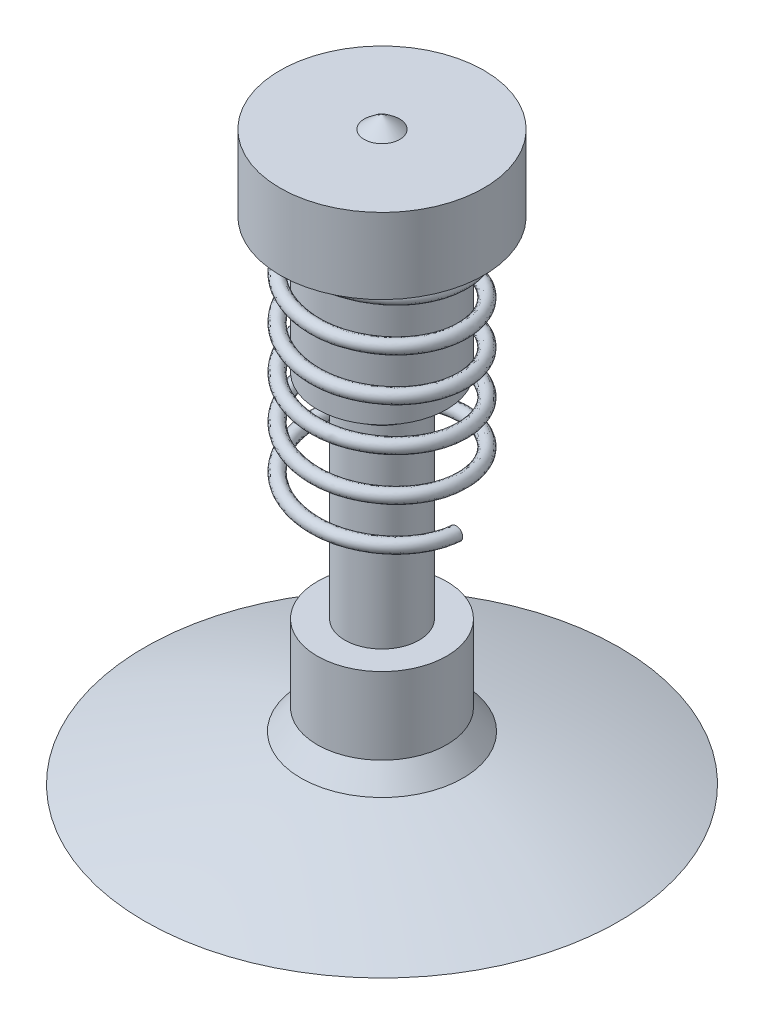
ISO-10303-21;
HEADER;
FILE_DESCRIPTION(('STEP AP214'),'2;1');
FILE_NAME('part.step','',(''),(''),'','','');
FILE_SCHEMA(('AUTOMOTIVE_DESIGN { 1 0 10303 214 1 1 1 1 }'));
ENDSEC;
DATA;
#1=APPLICATION_CONTEXT('core data for automotive mechanical design processes');
#2=APPLICATION_PROTOCOL_DEFINITION('international standard','automotive_design',2000,#1);
#3=PRODUCT_CONTEXT('',#1,'mechanical');
#4=PRODUCT('Part','Part','',(#3));
#5=PRODUCT_RELATED_PRODUCT_CATEGORY('part','',(#4));
#6=PRODUCT_DEFINITION_FORMATION('','',#4);
#7=PRODUCT_DEFINITION_CONTEXT('part definition',#1,'design');
#8=PRODUCT_DEFINITION('design','',#6,#7);
#9=PRODUCT_DEFINITION_SHAPE('','',#8);
#10=(LENGTH_UNIT() NAMED_UNIT(*) SI_UNIT(.MILLI.,.METRE.));
#11=(NAMED_UNIT(*) PLANE_ANGLE_UNIT() SI_UNIT($,.RADIAN.));
#12=(NAMED_UNIT(*) SI_UNIT($,.STERADIAN.) SOLID_ANGLE_UNIT());
#13=UNCERTAINTY_MEASURE_WITH_UNIT(LENGTH_MEASURE(1.E-05),#10,'distance_accuracy_value','');
#14=(GEOMETRIC_REPRESENTATION_CONTEXT(3) GLOBAL_UNCERTAINTY_ASSIGNED_CONTEXT((#13)) GLOBAL_UNIT_ASSIGNED_CONTEXT((#10,
#11,#12)) REPRESENTATION_CONTEXT('',''));
#15=CARTESIAN_POINT('',(0.,0.,0.));
#16=DIRECTION('',(0.,0.,1.));
#17=DIRECTION('',(1.,0.,0.));
#18=AXIS2_PLACEMENT_3D('',#15,#16,#17);
#19=CARTESIAN_POINT('',(0.3,2.28,0.));
#20=DIRECTION('',(0.,1.,0.));
#21=DIRECTION('',(0.,0.,1.));
#22=AXIS2_PLACEMENT_3D('',#19,#20,#21);
#23=PLANE('',#22);
#24=CARTESIAN_POINT('',(0.,2.28,0.));
#25=DIRECTION('',(0.,1.,0.));
#26=DIRECTION('',(0.,0.,1.));
#27=AXIS2_PLACEMENT_3D('',#24,#25,#26);
#28=CIRCLE('',#27,0.3);
#29=CARTESIAN_POINT('',(0.,2.28,0.3));
#30=VERTEX_POINT('',#29);
#31=EDGE_CURVE('E78',#30,#30,#28,.T.);
#32=ORIENTED_EDGE('',*,*,#31,.T.);
#33=EDGE_LOOP('',(#32));
#34=FACE_BOUND('',#33,.T.);
#35=CARTESIAN_POINT('',(0.,2.28,0.));
#36=DIRECTION('',(0.,1.,0.));
#37=DIRECTION('',(0.,0.,1.));
#38=AXIS2_PLACEMENT_3D('',#35,#36,#37);
#39=CIRCLE('',#38,0.472614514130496);
#40=CARTESIAN_POINT('',(0.,2.28,0.472614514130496));
#41=VERTEX_POINT('',#40);
#42=EDGE_CURVE('E75',#41,#41,#39,.T.);
#43=ORIENTED_EDGE('',*,*,#42,.F.);
#44=EDGE_LOOP('',(#43));
#45=FACE_BOUND('',#44,.T.);
#46=DIRECTION('',(1.,0.,0.));
#47=VECTOR('',#46,1.);
#48=CARTESIAN_POINT('',(0.3,2.28,0.));
#49=LINE('',#48,#47);
#50=CARTESIAN_POINT('',(-0.374,2.28,0.));
#51=VERTEX_POINT('',#50);
#52=CARTESIAN_POINT('',(-0.314,2.28,0.));
#53=VERTEX_POINT('',#52);
#54=EDGE_CURVE('E11',#51,#53,#49,.T.);
#55=ORIENTED_EDGE('',*,*,#54,.F.);
#56=CARTESIAN_POINT('',(-0.314,2.28,0.));
#57=CARTESIAN_POINT('',(-0.31400021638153,2.27999999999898,0.00996292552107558));
#58=CARTESIAN_POINT('',(-0.313567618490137,2.27999999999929,0.0199201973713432));
#59=CARTESIAN_POINT('',(-0.311855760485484,2.28000000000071,0.0397696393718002));
#60=CARTESIAN_POINT('',(-0.310575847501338,2.2800000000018,0.0496617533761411));
#61=CARTESIAN_POINT('',(-0.305455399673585,2.28000000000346,0.0793641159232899));
#62=CARTESIAN_POINT('',(-0.300334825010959,2.2800000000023,0.0989664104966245));
#63=CARTESIAN_POINT('',(-0.286986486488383,2.2799999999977,0.137080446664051));
#64=CARTESIAN_POINT('',(-0.278756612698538,2.27999999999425,0.155591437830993));
#65=CARTESIAN_POINT('',(-0.264292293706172,2.27999999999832,0.182562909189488));
#66=CARTESIAN_POINT('',(-0.25901758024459,2.28000000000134,0.191554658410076));
#67=CARTESIAN_POINT('',(-0.247875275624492,2.27999999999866,0.209143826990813));
#68=CARTESIAN_POINT('',(-0.242008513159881,2.27999999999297,0.217741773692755));
#69=CARTESIAN_POINT('',(-0.231938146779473,2.28000000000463,0.231760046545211));
#70=CARTESIAN_POINT('',(-0.227849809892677,2.28000000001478,0.237263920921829));
#71=CARTESIAN_POINT('',(-0.219615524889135,2.27999999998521,0.248227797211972));
#72=CARTESIAN_POINT('',(-0.215469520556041,2.27999999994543,0.253687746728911));
#73=CARTESIAN_POINT('',(-0.209566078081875,2.28000000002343,0.262088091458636));
#74=CARTESIAN_POINT('',(-0.207661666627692,2.28000000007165,0.264905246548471));
#75=CARTESIAN_POINT('',(-0.205578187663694,2.2799999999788,0.268766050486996));
#76=CARTESIAN_POINT('',(-0.205128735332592,2.27999999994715,0.269661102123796));
#77=CARTESIAN_POINT('',(-0.204313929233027,2.27999999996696,0.271552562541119));
#78=CARTESIAN_POINT('',(-0.203953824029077,2.28000000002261,0.272551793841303));
#79=CARTESIAN_POINT('',(-0.203688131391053,2.27999999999,0.274045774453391));
#80=CARTESIAN_POINT('',(-0.20364105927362,2.2799999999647,0.274511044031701));
#81=CARTESIAN_POINT('',(-0.203673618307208,2.27999999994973,0.275376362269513));
#82=CARTESIAN_POINT('',(-0.203735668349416,2.27999999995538,0.275775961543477));
#83=CARTESIAN_POINT('',(-0.204109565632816,2.2799999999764,0.276712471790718));
#84=CARTESIAN_POINT('',(-0.204535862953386,2.27999999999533,0.277210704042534));
#85=CARTESIAN_POINT('',(-0.205429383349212,2.28000000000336,0.27778033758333));
#86=CARTESIAN_POINT('',(-0.205855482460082,2.27999999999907,0.27793006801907));
#87=CARTESIAN_POINT('',(-0.207106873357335,2.27999999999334,0.278227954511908));
#88=CARTESIAN_POINT('',(-0.207952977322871,2.27999999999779,0.278258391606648));
#89=CARTESIAN_POINT('',(-0.210200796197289,2.28000000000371,0.278156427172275));
#90=CARTESIAN_POINT('',(-0.211589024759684,2.28000000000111,0.277899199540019));
#91=CARTESIAN_POINT('',(-0.21433204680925,2.27999999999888,0.277229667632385));
#92=CARTESIAN_POINT('',(-0.215686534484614,2.27999999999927,0.27681627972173));
#93=CARTESIAN_POINT('',(-0.219738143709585,2.27999999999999,0.275422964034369));
#94=CARTESIAN_POINT('',(-0.222384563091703,2.27999999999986,0.274297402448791));
#95=CARTESIAN_POINT('',(-0.22758457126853,2.28000000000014,0.271846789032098));
#96=CARTESIAN_POINT('',(-0.23013793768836,2.28000000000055,0.270521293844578));
#97=CARTESIAN_POINT('',(-0.237674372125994,2.27999999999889,0.266331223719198));
#98=CARTESIAN_POINT('',(-0.242537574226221,2.27999999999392,0.263251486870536));
#99=CARTESIAN_POINT('',(-0.259293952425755,2.27999999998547,0.251680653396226));
#100=CARTESIAN_POINT('',(-0.270475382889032,2.2799999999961,0.242162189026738));
#101=CARTESIAN_POINT('',(-0.291271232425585,2.28000000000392,0.221496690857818));
#102=CARTESIAN_POINT('',(-0.30087765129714,2.28000000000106,0.210341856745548));
#103=CARTESIAN_POINT('',(-0.318603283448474,2.27999999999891,0.186501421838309));
#104=CARTESIAN_POINT('',(-0.326682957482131,2.27999999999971,0.173786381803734));
#105=CARTESIAN_POINT('',(-0.340974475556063,2.28000000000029,0.147395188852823));
#106=CARTESIAN_POINT('',(-0.347190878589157,2.28000000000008,0.133721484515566));
#107=CARTESIAN_POINT('',(-0.358791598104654,2.27999999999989,0.102806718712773));
#108=CARTESIAN_POINT('',(-0.363750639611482,2.27999999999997,0.08540507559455));
#109=CARTESIAN_POINT('',(-0.370842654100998,2.28000000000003,0.0500571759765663));
#110=CARTESIAN_POINT('',(-0.372979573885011,2.28,0.0321117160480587));
#111=CARTESIAN_POINT('',(-0.373904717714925,2.28,0.00942030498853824));
#112=CARTESIAN_POINT('',(-0.374000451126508,2.28,0.00470922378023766));
#113=CARTESIAN_POINT('',(-0.374,2.28,0.));
#114=B_SPLINE_CURVE_WITH_KNOTS('',3,(#56,#57,#58,#59,#60,#61,#62,#63,#64,#65,#66,#67,#68,#69,
#70,#71,#72,#73,#74,#75,#76,#77,#78,#79,#80,#81,#82,#83,#84,#85,#86,#87,#88,#89,#90,#91,#92,#93,
#94,#95,#96,#97,#98,#99,#100,#101,#102,#103,#104,#105,#106,#107,#108,#109,#110,#111,#112,#113),
.UNSPECIFIED.,.F.,.F.,(4,2,2,2,2,2,2,2,2,2,2,2,2,2,2,2,2,2,2,2,2,2,2,2,2,2,2,2,4),(0.,
0.0298688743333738,0.0597607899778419,0.120237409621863,0.180755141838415,0.212006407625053,
0.243214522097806,0.26377785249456,0.284362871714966,0.294530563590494,0.297535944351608,
0.300689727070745,0.302084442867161,0.303274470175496,0.305091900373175,0.306425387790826,
0.308934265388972,0.313149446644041,0.317394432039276,0.326001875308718,0.334628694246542,
0.351870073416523,0.395672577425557,0.439691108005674,0.484727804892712,0.529653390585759,
0.583701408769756,0.637673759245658,0.651805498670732),.UNSPECIFIED.);
#115=EDGE_CURVE('E46',#53,#51,#114,.T.);
#116=ORIENTED_EDGE('',*,*,#115,.F.);
#117=EDGE_LOOP('',(#55,#116));
#118=FACE_BOUND('',#117,.T.);
#119=ADVANCED_FACE('F38',(#34,#45,#118),#23,.F.);
#120=CARTESIAN_POINT('',(0.,2.11836840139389,-0.353368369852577));
#121=DIRECTION('',(-1.,0.,0.));
#122=DIRECTION('',(0.,0.,1.));
#123=AXIS2_PLACEMENT_3D('',#120,#121,#122);
#124=CIRCLE('',#123,0.672035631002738);
#125=TRIMMED_CURVE('',#124,(PARAMETER_VALUE(-1.01711992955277)),
(PARAMETER_VALUE(1.01711992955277)),.T.,.PARAMETER.);
#126=CARTESIAN_POINT('',(0.,2.11836840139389,0.));
#127=DIRECTION('',(0.,1.,0.));
#128=AXIS1_PLACEMENT('',#126,#127);
#129=SURFACE_OF_REVOLUTION('',#125,#128);
#130=CARTESIAN_POINT('',(0.,2.69,0.));
#131=VERTEX_POINT('',#130);
#132=VERTEX_LOOP('',#131);
#133=FACE_BOUND('',#132,.T.);
#134=CARTESIAN_POINT('',(0.,2.63,0.));
#135=DIRECTION('',(0.,1.,0.));
#136=DIRECTION('',(0.,0.,1.));
#137=AXIS2_PLACEMENT_3D('',#134,#135,#136);
#138=CIRCLE('',#137,0.0823666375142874);
#139=CARTESIAN_POINT('',(0.,2.63,0.0823666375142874));
#140=VERTEX_POINT('',#139);
#141=EDGE_CURVE('E67',#140,#140,#138,.T.);
#142=ORIENTED_EDGE('',*,*,#141,.T.);
#143=EDGE_LOOP('',(#142));
#144=FACE_BOUND('',#143,.T.);
#145=ADVANCED_FACE('F40',(#133,#144),#129,.T.);
#146=CARTESIAN_POINT('',(0.,0.,0.));
#147=DIRECTION('',(0.,1.,0.));
#148=DIRECTION('',(0.,0.,1.));
#149=AXIS2_PLACEMENT_3D('',#146,#147,#148);
#150=PLANE('',#149);
#151=CARTESIAN_POINT('',(0.,0.,0.));
#152=DIRECTION('',(0.,1.,0.));
#153=DIRECTION('',(0.,0.,1.));
#154=AXIS2_PLACEMENT_3D('',#151,#152,#153);
#155=CIRCLE('',#154,1.1);
#156=CARTESIAN_POINT('',(0.,0.,1.1));
#157=VERTEX_POINT('',#156);
#158=EDGE_CURVE('E62',#157,#157,#155,.T.);
#159=ORIENTED_EDGE('',*,*,#158,.F.);
#160=EDGE_LOOP('',(#159));
#161=FACE_BOUND('',#160,.T.);
#162=ADVANCED_FACE('F146',(#161),#150,.F.);
#163=CARTESIAN_POINT('',(0.,-4.93281597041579,0.));
#164=DIRECTION('',(0.,1.,0.));
#165=DIRECTION('',(0.,0.,1.));
#166=AXIS2_PLACEMENT_3D('',#163,#164,#165);
#167=DEGENERATE_TOROIDAL_SURFACE('',#166,0.740250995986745,5.26490238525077,.F.);
#168=CARTESIAN_POINT('',(0.,0.212454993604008,0.));
#169=DIRECTION('',(0.,1.,0.));
#170=DIRECTION('',(0.,0.,1.));
#171=AXIS2_PLACEMENT_3D('',#168,#169,#170);
#172=CIRCLE('',#171,0.375716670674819);
#173=CARTESIAN_POINT('',(0.,0.212454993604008,0.375716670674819));
#174=VERTEX_POINT('',#173);
#175=EDGE_CURVE('E96',#174,#174,#172,.T.);
#176=ORIENTED_EDGE('',*,*,#175,.F.);
#177=EDGE_LOOP('',(#176));
#178=FACE_BOUND('',#177,.T.);
#179=ORIENTED_EDGE('',*,*,#158,.T.);
#180=EDGE_LOOP('',(#179));
#181=FACE_BOUND('',#180,.T.);
#182=ADVANCED_FACE('F179',(#178,#181),#167,.F.);
#183=CARTESIAN_POINT('',(0.,0.212454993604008,0.));
#184=DIRECTION('',(0.,-1.,0.));
#185=DIRECTION('',(0.,0.,-1.));
#186=AXIS2_PLACEMENT_3D('',#183,#184,#185);
#187=CONICAL_SURFACE('',#186,0.375716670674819,0.666999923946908);
#188=CARTESIAN_POINT('',(0.,0.30861748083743,0.));
#189=DIRECTION('',(0.,1.,0.));
#190=DIRECTION('',(0.,0.,1.));
#191=AXIS2_PLACEMENT_3D('',#188,#189,#190);
#192=CIRCLE('',#191,0.3);
#193=CARTESIAN_POINT('',(0.,0.30861748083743,0.3));
#194=VERTEX_POINT('',#193);
#195=EDGE_CURVE('E93',#194,#194,#192,.T.);
#196=ORIENTED_EDGE('',*,*,#195,.F.);
#197=EDGE_LOOP('',(#196));
#198=FACE_BOUND('',#197,.T.);
#199=ORIENTED_EDGE('',*,*,#175,.T.);
#200=EDGE_LOOP('',(#199));
#201=FACE_BOUND('',#200,.T.);
#202=ADVANCED_FACE('F173',(#198,#201),#187,.T.);
#203=CARTESIAN_POINT('',(0.,2.69,0.));
#204=DIRECTION('',(0.,1.,0.));
#205=DIRECTION('',(0.,0.,1.));
#206=AXIS2_PLACEMENT_3D('',#203,#204,#205);
#207=CYLINDRICAL_SURFACE('',#206,0.3);
#208=CARTESIAN_POINT('',(0.,0.664482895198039,0.));
#209=DIRECTION('',(0.,1.,0.));
#210=DIRECTION('',(0.,0.,1.));
#211=AXIS2_PLACEMENT_3D('',#208,#209,#210);
#212=CIRCLE('',#211,0.3);
#213=CARTESIAN_POINT('',(0.,0.664482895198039,0.3));
#214=VERTEX_POINT('',#213);
#215=EDGE_CURVE('E90',#214,#214,#212,.T.);
#216=ORIENTED_EDGE('',*,*,#215,.F.);
#217=EDGE_LOOP('',(#216));
#218=FACE_BOUND('',#217,.T.);
#219=ORIENTED_EDGE('',*,*,#195,.T.);
#220=EDGE_LOOP('',(#219));
#221=FACE_BOUND('',#220,.T.);
#222=ADVANCED_FACE('F167',(#218,#221),#207,.T.);
#223=CARTESIAN_POINT('',(0.3,0.664482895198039,0.));
#224=DIRECTION('',(0.,-1.,0.));
#225=DIRECTION('',(0.,0.,-1.));
#226=AXIS2_PLACEMENT_3D('',#223,#224,#225);
#227=PLANE('',#226);
#228=CARTESIAN_POINT('',(0.,0.664482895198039,0.));
#229=DIRECTION('',(0.,1.,0.));
#230=DIRECTION('',(0.,0.,1.));
#231=AXIS2_PLACEMENT_3D('',#228,#229,#230);
#232=CIRCLE('',#231,0.172);
#233=CARTESIAN_POINT('',(0.,0.664482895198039,0.172));
#234=VERTEX_POINT('',#233);
#235=EDGE_CURVE('E87',#234,#234,#232,.T.);
#236=ORIENTED_EDGE('',*,*,#235,.F.);
#237=EDGE_LOOP('',(#236));
#238=FACE_BOUND('',#237,.T.);
#239=ORIENTED_EDGE('',*,*,#215,.T.);
#240=EDGE_LOOP('',(#239));
#241=FACE_BOUND('',#240,.T.);
#242=ADVANCED_FACE('F161',(#238,#241),#227,.F.);
#243=CARTESIAN_POINT('',(0.,2.69,0.));
#244=DIRECTION('',(0.,1.,0.));
#245=DIRECTION('',(0.,0.,1.));
#246=AXIS2_PLACEMENT_3D('',#243,#244,#245);
#247=CYLINDRICAL_SURFACE('',#246,0.172);
#248=CARTESIAN_POINT('',(0.,1.56220338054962,0.));
#249=DIRECTION('',(0.,1.,0.));
#250=DIRECTION('',(0.,0.,1.));
#251=AXIS2_PLACEMENT_3D('',#248,#249,#250);
#252=CIRCLE('',#251,0.172);
#253=CARTESIAN_POINT('',(0.,1.56220338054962,0.172));
#254=VERTEX_POINT('',#253);
#255=EDGE_CURVE('E84',#254,#254,#252,.T.);
#256=ORIENTED_EDGE('',*,*,#255,.F.);
#257=EDGE_LOOP('',(#256));
#258=FACE_BOUND('',#257,.T.);
#259=ORIENTED_EDGE('',*,*,#235,.T.);
#260=EDGE_LOOP('',(#259));
#261=FACE_BOUND('',#260,.T.);
#262=ADVANCED_FACE('F155',(#258,#261),#247,.T.);
#263=CARTESIAN_POINT('',(0.,1.56220338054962,0.));
#264=DIRECTION('',(0.,1.,0.));
#265=DIRECTION('',(0.,0.,1.));
#266=AXIS2_PLACEMENT_3D('',#263,#264,#265);
#267=CONICAL_SURFACE('',#266,0.172,0.943505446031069);
#268=CARTESIAN_POINT('',(0.,1.655,0.));
#269=DIRECTION('',(0.,1.,0.));
#270=DIRECTION('',(0.,0.,1.));
#271=AXIS2_PLACEMENT_3D('',#268,#269,#270);
#272=CIRCLE('',#271,0.3);
#273=CARTESIAN_POINT('',(0.,1.655,0.3));
#274=VERTEX_POINT('',#273);
#275=EDGE_CURVE('E81',#274,#274,#272,.T.);
#276=ORIENTED_EDGE('',*,*,#275,.F.);
#277=EDGE_LOOP('',(#276));
#278=FACE_BOUND('',#277,.T.);
#279=ORIENTED_EDGE('',*,*,#255,.T.);
#280=EDGE_LOOP('',(#279));
#281=FACE_BOUND('',#280,.T.);
#282=ADVANCED_FACE('F137',(#278,#281),#267,.T.);
#283=CARTESIAN_POINT('',(0.,2.69,0.));
#284=DIRECTION('',(0.,1.,0.));
#285=DIRECTION('',(0.,0.,1.));
#286=AXIS2_PLACEMENT_3D('',#283,#284,#285);
#287=CYLINDRICAL_SURFACE('',#286,0.3);
#288=ORIENTED_EDGE('',*,*,#31,.F.);
#289=EDGE_LOOP('',(#288));
#290=FACE_BOUND('',#289,.T.);
#291=ORIENTED_EDGE('',*,*,#275,.T.);
#292=EDGE_LOOP('',(#291));
#293=FACE_BOUND('',#292,.T.);
#294=ADVANCED_FACE('F132',(#290,#293),#287,.T.);
#295=CARTESIAN_POINT('',(0.,2.69,0.));
#296=DIRECTION('',(0.,1.,0.));
#297=DIRECTION('',(0.,0.,1.));
#298=AXIS2_PLACEMENT_3D('',#295,#296,#297);
#299=CYLINDRICAL_SURFACE('',#298,0.472614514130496);
#300=CARTESIAN_POINT('',(0.,2.63,0.));
#301=DIRECTION('',(0.,1.,0.));
#302=DIRECTION('',(0.,0.,1.));
#303=AXIS2_PLACEMENT_3D('',#300,#301,#302);
#304=CIRCLE('',#303,0.472614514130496);
#305=CARTESIAN_POINT('',(0.,2.63,0.472614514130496));
#306=VERTEX_POINT('',#305);
#307=EDGE_CURVE('E72',#306,#306,#304,.T.);
#308=ORIENTED_EDGE('',*,*,#307,.F.);
#309=EDGE_LOOP('',(#308));
#310=FACE_BOUND('',#309,.T.);
#311=ORIENTED_EDGE('',*,*,#42,.T.);
#312=EDGE_LOOP('',(#311));
#313=FACE_BOUND('',#312,.T.);
#314=ADVANCED_FACE('F129',(#310,#313),#299,.T.);
#315=CARTESIAN_POINT('',(0.472614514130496,2.63,0.));
#316=DIRECTION('',(0.,-1.,0.));
#317=DIRECTION('',(0.,0.,-1.));
#318=AXIS2_PLACEMENT_3D('',#315,#316,#317);
#319=PLANE('',#318);
#320=ORIENTED_EDGE('',*,*,#141,.F.);
#321=EDGE_LOOP('',(#320));
#322=FACE_BOUND('',#321,.T.);
#323=ORIENTED_EDGE('',*,*,#307,.T.);
#324=EDGE_LOOP('',(#323));
#325=FACE_BOUND('',#324,.T.);
#326=ADVANCED_FACE('F124',(#322,#325),#319,.F.);
#327=CARTESIAN_POINT('',(-0.314,2.28,0.));
#328=DIRECTION('',(0.,0.,1.));
#329=DIRECTION('',(1.,0.,0.));
#330=AXIS2_PLACEMENT_3D('',#327,#328,#329);
#331=PLANE('',#330);
#332=CARTESIAN_POINT('',(-0.344,2.28,0.));
#333=DIRECTION('',(0.,0.,-1.));
#334=DIRECTION('',(-1.,0.,0.));
#335=AXIS2_PLACEMENT_3D('',#332,#333,#334);
#336=CIRCLE('',#335,0.0299999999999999);
#337=EDGE_CURVE('E61',#53,#51,#336,.T.);
#338=ORIENTED_EDGE('',*,*,#337,.T.);
#339=ORIENTED_EDGE('',*,*,#54,.T.);
#340=EDGE_LOOP('',(#338,#339));
#341=FACE_BOUND('',#340,.T.);
#342=ADVANCED_FACE('F63',(#341),#331,.F.);
#343=CARTESIAN_POINT('',(-0.374,2.28,0.));
#344=CARTESIAN_POINT('',(-0.374000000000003,2.26333333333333,0.215929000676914));
#345=CARTESIAN_POINT('',(-0.187000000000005,2.24666666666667,0.323893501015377));
#346=CARTESIAN_POINT('',(0.,2.23,0.43185800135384));
#347=CARTESIAN_POINT('',(0.186999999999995,2.21333333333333,0.323893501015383));
#348=CARTESIAN_POINT('',(0.373999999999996,2.19666666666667,0.215929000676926));
#349=CARTESIAN_POINT('',(0.374,2.18,0.));
#350=CARTESIAN_POINT('',(0.374000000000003,2.16333333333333,-0.215929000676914));
#351=CARTESIAN_POINT('',(0.187000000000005,2.14666666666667,-0.323893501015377));
#352=CARTESIAN_POINT('',(0.,2.13,-0.43185800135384));
#353=CARTESIAN_POINT('',(-0.186999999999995,2.11333333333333,-0.323893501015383));
#354=CARTESIAN_POINT('',(-0.373999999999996,2.09666666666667,-0.215929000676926));
#355=CARTESIAN_POINT('',(-0.374,2.08,0.));
#356=CARTESIAN_POINT('',(-0.374000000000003,2.06333333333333,0.215929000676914));
#357=CARTESIAN_POINT('',(-0.187000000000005,2.04666666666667,0.323893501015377));
#358=CARTESIAN_POINT('',(0.,2.03,0.43185800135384));
#359=CARTESIAN_POINT('',(0.186999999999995,2.01333333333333,0.323893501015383));
#360=CARTESIAN_POINT('',(0.373999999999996,1.99666666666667,0.215929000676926));
#361=CARTESIAN_POINT('',(0.374,1.98,0.));
#362=CARTESIAN_POINT('',(0.374000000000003,1.96333333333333,-0.215929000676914));
#363=CARTESIAN_POINT('',(0.187000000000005,1.94666666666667,-0.323893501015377));
#364=CARTESIAN_POINT('',(0.,1.93,-0.43185800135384));
#365=CARTESIAN_POINT('',(-0.186999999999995,1.91333333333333,-0.323893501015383));
#366=CARTESIAN_POINT('',(-0.373999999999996,1.89666666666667,-0.215929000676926));
#367=CARTESIAN_POINT('',(-0.374,1.88,0.));
#368=CARTESIAN_POINT('',(-0.374000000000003,1.86333333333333,0.215929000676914));
#369=CARTESIAN_POINT('',(-0.187000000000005,1.84666666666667,0.323893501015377));
#370=CARTESIAN_POINT('',(0.,1.83,0.43185800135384));
#371=CARTESIAN_POINT('',(0.186999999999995,1.81333333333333,0.323893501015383));
#372=CARTESIAN_POINT('',(0.373999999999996,1.79666666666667,0.215929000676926));
#373=CARTESIAN_POINT('',(0.374,1.78,0.));
#374=CARTESIAN_POINT('',(0.374000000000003,1.76333333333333,-0.215929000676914));
#375=CARTESIAN_POINT('',(0.187000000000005,1.74666666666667,-0.323893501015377));
#376=CARTESIAN_POINT('',(0.,1.73,-0.43185800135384));
#377=CARTESIAN_POINT('',(-0.186999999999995,1.71333333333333,-0.323893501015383));
#378=CARTESIAN_POINT('',(-0.373999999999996,1.69666666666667,-0.215929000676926));
#379=CARTESIAN_POINT('',(-0.374,1.68,0.));
#380=CARTESIAN_POINT('',(-0.374000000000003,1.66333333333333,0.215929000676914));
#381=CARTESIAN_POINT('',(-0.187000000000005,1.64666666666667,0.323893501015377));
#382=CARTESIAN_POINT('',(0.,1.63,0.43185800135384));
#383=CARTESIAN_POINT('',(0.186999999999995,1.61333333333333,0.323893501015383));
#384=CARTESIAN_POINT('',(0.373999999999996,1.59666666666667,0.215929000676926));
#385=CARTESIAN_POINT('',(0.374,1.58,0.));
#386=CARTESIAN_POINT('',(0.374000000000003,1.56333333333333,-0.215929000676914));
#387=CARTESIAN_POINT('',(0.187000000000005,1.54666666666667,-0.323893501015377));
#388=CARTESIAN_POINT('',(0.,1.53,-0.43185800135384));
#389=CARTESIAN_POINT('',(-0.186999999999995,1.51333333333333,-0.323893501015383));
#390=CARTESIAN_POINT('',(-0.373999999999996,1.49666666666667,-0.215929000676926));
#391=CARTESIAN_POINT('',(-0.374,1.48,0.));
#392=CARTESIAN_POINT('',(-0.374000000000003,1.46333333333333,0.215929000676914));
#393=CARTESIAN_POINT('',(-0.187000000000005,1.44666666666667,0.323893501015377));
#394=CARTESIAN_POINT('',(0.,1.43,0.43185800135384));
#395=CARTESIAN_POINT('',(0.186999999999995,1.41333333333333,0.323893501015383));
#396=CARTESIAN_POINT('',(0.373999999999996,1.39666666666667,0.215929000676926));
#397=CARTESIAN_POINT('',(0.374,1.38,0.));
#398=CARTESIAN_POINT('',(0.374000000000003,1.36333333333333,-0.215929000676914));
#399=CARTESIAN_POINT('',(0.187000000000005,1.34666666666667,-0.323893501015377));
#400=CARTESIAN_POINT('',(0.,1.33,-0.43185800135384));
#401=CARTESIAN_POINT('',(-0.186999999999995,1.31333333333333,-0.323893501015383));
#402=CARTESIAN_POINT('',(-0.373999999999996,1.29666666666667,-0.215929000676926));
#403=CARTESIAN_POINT('',(-0.374,1.28,0.));
#404=CARTESIAN_POINT('',(-0.374000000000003,1.26333333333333,0.215929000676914));
#405=CARTESIAN_POINT('',(-0.187000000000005,1.24666666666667,0.323893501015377));
#406=CARTESIAN_POINT('',(0.,1.23,0.43185800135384));
#407=CARTESIAN_POINT('',(0.186999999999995,1.21333333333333,0.323893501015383));
#408=CARTESIAN_POINT('',(0.373999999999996,1.19666666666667,0.215929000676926));
#409=CARTESIAN_POINT('',(0.374,1.18,0.));
#410=CARTESIAN_POINT('',(-0.374,2.34,0.));
#411=CARTESIAN_POINT('',(-0.374000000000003,2.32333333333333,0.215929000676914));
#412=CARTESIAN_POINT('',(-0.187000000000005,2.30666666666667,0.323893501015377));
#413=CARTESIAN_POINT('',(0.,2.29,0.43185800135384));
#414=CARTESIAN_POINT('',(0.186999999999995,2.27333333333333,0.323893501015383));
#415=CARTESIAN_POINT('',(0.373999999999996,2.25666666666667,0.215929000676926));
#416=CARTESIAN_POINT('',(0.374,2.24,0.));
#417=CARTESIAN_POINT('',(0.374000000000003,2.22333333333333,-0.215929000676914));
#418=CARTESIAN_POINT('',(0.187000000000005,2.20666666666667,-0.323893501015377));
#419=CARTESIAN_POINT('',(0.,2.19,-0.43185800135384));
#420=CARTESIAN_POINT('',(-0.186999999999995,2.17333333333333,-0.323893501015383));
#421=CARTESIAN_POINT('',(-0.373999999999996,2.15666666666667,-0.215929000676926));
#422=CARTESIAN_POINT('',(-0.374,2.14,0.));
#423=CARTESIAN_POINT('',(-0.374000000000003,2.12333333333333,0.215929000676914));
#424=CARTESIAN_POINT('',(-0.187000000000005,2.10666666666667,0.323893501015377));
#425=CARTESIAN_POINT('',(0.,2.09,0.43185800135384));
#426=CARTESIAN_POINT('',(0.186999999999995,2.07333333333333,0.323893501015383));
#427=CARTESIAN_POINT('',(0.373999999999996,2.05666666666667,0.215929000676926));
#428=CARTESIAN_POINT('',(0.374,2.04,0.));
#429=CARTESIAN_POINT('',(0.374000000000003,2.02333333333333,-0.215929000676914));
#430=CARTESIAN_POINT('',(0.187000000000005,2.00666666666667,-0.323893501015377));
#431=CARTESIAN_POINT('',(0.,1.99,-0.43185800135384));
#432=CARTESIAN_POINT('',(-0.186999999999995,1.97333333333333,-0.323893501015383));
#433=CARTESIAN_POINT('',(-0.373999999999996,1.95666666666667,-0.215929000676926));
#434=CARTESIAN_POINT('',(-0.374,1.94,0.));
#435=CARTESIAN_POINT('',(-0.374000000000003,1.92333333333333,0.215929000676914));
#436=CARTESIAN_POINT('',(-0.187000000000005,1.90666666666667,0.323893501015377));
#437=CARTESIAN_POINT('',(0.,1.89,0.43185800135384));
#438=CARTESIAN_POINT('',(0.186999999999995,1.87333333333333,0.323893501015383));
#439=CARTESIAN_POINT('',(0.373999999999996,1.85666666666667,0.215929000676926));
#440=CARTESIAN_POINT('',(0.374,1.84,0.));
#441=CARTESIAN_POINT('',(0.374000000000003,1.82333333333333,-0.215929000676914));
#442=CARTESIAN_POINT('',(0.187000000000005,1.80666666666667,-0.323893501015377));
#443=CARTESIAN_POINT('',(0.,1.79,-0.43185800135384));
#444=CARTESIAN_POINT('',(-0.186999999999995,1.77333333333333,-0.323893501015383));
#445=CARTESIAN_POINT('',(-0.373999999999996,1.75666666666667,-0.215929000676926));
#446=CARTESIAN_POINT('',(-0.374,1.74,0.));
#447=CARTESIAN_POINT('',(-0.374000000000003,1.72333333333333,0.215929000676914));
#448=CARTESIAN_POINT('',(-0.187000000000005,1.70666666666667,0.323893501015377));
#449=CARTESIAN_POINT('',(0.,1.69,0.43185800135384));
#450=CARTESIAN_POINT('',(0.186999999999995,1.67333333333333,0.323893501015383));
#451=CARTESIAN_POINT('',(0.373999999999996,1.65666666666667,0.215929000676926));
#452=CARTESIAN_POINT('',(0.374,1.64,0.));
#453=CARTESIAN_POINT('',(0.374000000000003,1.62333333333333,-0.215929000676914));
#454=CARTESIAN_POINT('',(0.187000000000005,1.60666666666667,-0.323893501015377));
#455=CARTESIAN_POINT('',(0.,1.59,-0.43185800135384));
#456=CARTESIAN_POINT('',(-0.186999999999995,1.57333333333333,-0.323893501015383));
#457=CARTESIAN_POINT('',(-0.373999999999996,1.55666666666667,-0.215929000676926));
#458=CARTESIAN_POINT('',(-0.374,1.54,0.));
#459=CARTESIAN_POINT('',(-0.374000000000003,1.52333333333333,0.215929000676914));
#460=CARTESIAN_POINT('',(-0.187000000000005,1.50666666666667,0.323893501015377));
#461=CARTESIAN_POINT('',(0.,1.49,0.43185800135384));
#462=CARTESIAN_POINT('',(0.186999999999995,1.47333333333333,0.323893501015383));
#463=CARTESIAN_POINT('',(0.373999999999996,1.45666666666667,0.215929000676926));
#464=CARTESIAN_POINT('',(0.374,1.44,0.));
#465=CARTESIAN_POINT('',(0.374000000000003,1.42333333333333,-0.215929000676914));
#466=CARTESIAN_POINT('',(0.187000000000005,1.40666666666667,-0.323893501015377));
#467=CARTESIAN_POINT('',(0.,1.39,-0.43185800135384));
#468=CARTESIAN_POINT('',(-0.186999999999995,1.37333333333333,-0.323893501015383));
#469=CARTESIAN_POINT('',(-0.373999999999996,1.35666666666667,-0.215929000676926));
#470=CARTESIAN_POINT('',(-0.374,1.34,0.));
#471=CARTESIAN_POINT('',(-0.374000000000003,1.32333333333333,0.215929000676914));
#472=CARTESIAN_POINT('',(-0.187000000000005,1.30666666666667,0.323893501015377));
#473=CARTESIAN_POINT('',(0.,1.29,0.43185800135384));
#474=CARTESIAN_POINT('',(0.186999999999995,1.27333333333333,0.323893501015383));
#475=CARTESIAN_POINT('',(0.373999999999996,1.25666666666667,0.215929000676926));
#476=CARTESIAN_POINT('',(0.374,1.24,0.));
#477=CARTESIAN_POINT('',(-0.314,2.34,0.));
#478=CARTESIAN_POINT('',(-0.314000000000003,2.32333333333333,0.181287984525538));
#479=CARTESIAN_POINT('',(-0.157000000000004,2.30666666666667,0.271931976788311));
#480=CARTESIAN_POINT('',(0.,2.29,0.362575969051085));
#481=CARTESIAN_POINT('',(0.156999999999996,2.27333333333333,0.271931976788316));
#482=CARTESIAN_POINT('',(0.313999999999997,2.25666666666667,0.181287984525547));
#483=CARTESIAN_POINT('',(0.314,2.24,0.));
#484=CARTESIAN_POINT('',(0.314000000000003,2.22333333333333,-0.181287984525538));
#485=CARTESIAN_POINT('',(0.157000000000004,2.20666666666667,-0.271931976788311));
#486=CARTESIAN_POINT('',(0.,2.19,-0.362575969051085));
#487=CARTESIAN_POINT('',(-0.156999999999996,2.17333333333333,-0.271931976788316));
#488=CARTESIAN_POINT('',(-0.313999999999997,2.15666666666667,-0.181287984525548));
#489=CARTESIAN_POINT('',(-0.314,2.14,0.));
#490=CARTESIAN_POINT('',(-0.314000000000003,2.12333333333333,0.181287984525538));
#491=CARTESIAN_POINT('',(-0.157000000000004,2.10666666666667,0.271931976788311));
#492=CARTESIAN_POINT('',(0.,2.09,0.362575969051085));
#493=CARTESIAN_POINT('',(0.156999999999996,2.07333333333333,0.271931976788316));
#494=CARTESIAN_POINT('',(0.313999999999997,2.05666666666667,0.181287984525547));
#495=CARTESIAN_POINT('',(0.314,2.04,0.));
#496=CARTESIAN_POINT('',(0.314000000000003,2.02333333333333,-0.181287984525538));
#497=CARTESIAN_POINT('',(0.157000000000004,2.00666666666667,-0.271931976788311));
#498=CARTESIAN_POINT('',(0.,1.99,-0.362575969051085));
#499=CARTESIAN_POINT('',(-0.156999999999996,1.97333333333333,-0.271931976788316));
#500=CARTESIAN_POINT('',(-0.313999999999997,1.95666666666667,-0.181287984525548));
#501=CARTESIAN_POINT('',(-0.314,1.94,0.));
#502=CARTESIAN_POINT('',(-0.314000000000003,1.92333333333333,0.181287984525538));
#503=CARTESIAN_POINT('',(-0.157000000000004,1.90666666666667,0.271931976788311));
#504=CARTESIAN_POINT('',(0.,1.89,0.362575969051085));
#505=CARTESIAN_POINT('',(0.156999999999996,1.87333333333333,0.271931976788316));
#506=CARTESIAN_POINT('',(0.313999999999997,1.85666666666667,0.181287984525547));
#507=CARTESIAN_POINT('',(0.314,1.84,0.));
#508=CARTESIAN_POINT('',(0.314000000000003,1.82333333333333,-0.181287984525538));
#509=CARTESIAN_POINT('',(0.157000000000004,1.80666666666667,-0.271931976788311));
#510=CARTESIAN_POINT('',(0.,1.79,-0.362575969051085));
#511=CARTESIAN_POINT('',(-0.156999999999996,1.77333333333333,-0.271931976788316));
#512=CARTESIAN_POINT('',(-0.313999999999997,1.75666666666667,-0.181287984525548));
#513=CARTESIAN_POINT('',(-0.314,1.74,0.));
#514=CARTESIAN_POINT('',(-0.314000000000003,1.72333333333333,0.181287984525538));
#515=CARTESIAN_POINT('',(-0.157000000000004,1.70666666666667,0.271931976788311));
#516=CARTESIAN_POINT('',(0.,1.69,0.362575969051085));
#517=CARTESIAN_POINT('',(0.156999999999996,1.67333333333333,0.271931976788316));
#518=CARTESIAN_POINT('',(0.313999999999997,1.65666666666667,0.181287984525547));
#519=CARTESIAN_POINT('',(0.314,1.64,0.));
#520=CARTESIAN_POINT('',(0.314000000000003,1.62333333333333,-0.181287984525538));
#521=CARTESIAN_POINT('',(0.157000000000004,1.60666666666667,-0.271931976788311));
#522=CARTESIAN_POINT('',(0.,1.59,-0.362575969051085));
#523=CARTESIAN_POINT('',(-0.156999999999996,1.57333333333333,-0.271931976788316));
#524=CARTESIAN_POINT('',(-0.313999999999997,1.55666666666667,-0.181287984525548));
#525=CARTESIAN_POINT('',(-0.314,1.54,0.));
#526=CARTESIAN_POINT('',(-0.314000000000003,1.52333333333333,0.181287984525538));
#527=CARTESIAN_POINT('',(-0.157000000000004,1.50666666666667,0.271931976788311));
#528=CARTESIAN_POINT('',(0.,1.49,0.362575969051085));
#529=CARTESIAN_POINT('',(0.156999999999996,1.47333333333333,0.271931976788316));
#530=CARTESIAN_POINT('',(0.313999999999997,1.45666666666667,0.181287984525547));
#531=CARTESIAN_POINT('',(0.314,1.44,0.));
#532=CARTESIAN_POINT('',(0.314000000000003,1.42333333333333,-0.181287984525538));
#533=CARTESIAN_POINT('',(0.157000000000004,1.40666666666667,-0.271931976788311));
#534=CARTESIAN_POINT('',(0.,1.39,-0.362575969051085));
#535=CARTESIAN_POINT('',(-0.156999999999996,1.37333333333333,-0.271931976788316));
#536=CARTESIAN_POINT('',(-0.313999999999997,1.35666666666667,-0.181287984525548));
#537=CARTESIAN_POINT('',(-0.314,1.34,0.));
#538=CARTESIAN_POINT('',(-0.314000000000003,1.32333333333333,0.181287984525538));
#539=CARTESIAN_POINT('',(-0.157000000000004,1.30666666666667,0.271931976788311));
#540=CARTESIAN_POINT('',(0.,1.29,0.362575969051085));
#541=CARTESIAN_POINT('',(0.156999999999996,1.27333333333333,0.271931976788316));
#542=CARTESIAN_POINT('',(0.313999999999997,1.25666666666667,0.181287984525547));
#543=CARTESIAN_POINT('',(0.314,1.24,0.));
#544=CARTESIAN_POINT('',(-0.314,2.28,0.));
#545=CARTESIAN_POINT('',(-0.314000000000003,2.26333333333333,0.181287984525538));
#546=CARTESIAN_POINT('',(-0.157000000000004,2.24666666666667,0.271931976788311));
#547=CARTESIAN_POINT('',(0.,2.23,0.362575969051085));
#548=CARTESIAN_POINT('',(0.156999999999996,2.21333333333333,0.271931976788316));
#549=CARTESIAN_POINT('',(0.313999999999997,2.19666666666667,0.181287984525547));
#550=CARTESIAN_POINT('',(0.314,2.18,0.));
#551=CARTESIAN_POINT('',(0.314000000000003,2.16333333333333,-0.181287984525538));
#552=CARTESIAN_POINT('',(0.157000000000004,2.14666666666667,-0.271931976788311));
#553=CARTESIAN_POINT('',(0.,2.13,-0.362575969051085));
#554=CARTESIAN_POINT('',(-0.156999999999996,2.11333333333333,-0.271931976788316));
#555=CARTESIAN_POINT('',(-0.313999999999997,2.09666666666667,-0.181287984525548));
#556=CARTESIAN_POINT('',(-0.314,2.08,0.));
#557=CARTESIAN_POINT('',(-0.314000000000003,2.06333333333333,0.181287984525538));
#558=CARTESIAN_POINT('',(-0.157000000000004,2.04666666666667,0.271931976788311));
#559=CARTESIAN_POINT('',(0.,2.03,0.362575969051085));
#560=CARTESIAN_POINT('',(0.156999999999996,2.01333333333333,0.271931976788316));
#561=CARTESIAN_POINT('',(0.313999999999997,1.99666666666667,0.181287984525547));
#562=CARTESIAN_POINT('',(0.314,1.98,0.));
#563=CARTESIAN_POINT('',(0.314000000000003,1.96333333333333,-0.181287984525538));
#564=CARTESIAN_POINT('',(0.157000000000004,1.94666666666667,-0.271931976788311));
#565=CARTESIAN_POINT('',(0.,1.93,-0.362575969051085));
#566=CARTESIAN_POINT('',(-0.156999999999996,1.91333333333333,-0.271931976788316));
#567=CARTESIAN_POINT('',(-0.313999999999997,1.89666666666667,-0.181287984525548));
#568=CARTESIAN_POINT('',(-0.314,1.88,0.));
#569=CARTESIAN_POINT('',(-0.314000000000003,1.86333333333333,0.181287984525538));
#570=CARTESIAN_POINT('',(-0.157000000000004,1.84666666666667,0.271931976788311));
#571=CARTESIAN_POINT('',(0.,1.83,0.362575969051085));
#572=CARTESIAN_POINT('',(0.156999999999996,1.81333333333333,0.271931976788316));
#573=CARTESIAN_POINT('',(0.313999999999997,1.79666666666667,0.181287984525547));
#574=CARTESIAN_POINT('',(0.314,1.78,0.));
#575=CARTESIAN_POINT('',(0.314000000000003,1.76333333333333,-0.181287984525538));
#576=CARTESIAN_POINT('',(0.157000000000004,1.74666666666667,-0.271931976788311));
#577=CARTESIAN_POINT('',(0.,1.73,-0.362575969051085));
#578=CARTESIAN_POINT('',(-0.156999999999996,1.71333333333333,-0.271931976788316));
#579=CARTESIAN_POINT('',(-0.313999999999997,1.69666666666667,-0.181287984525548));
#580=CARTESIAN_POINT('',(-0.314,1.68,0.));
#581=CARTESIAN_POINT('',(-0.314000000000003,1.66333333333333,0.181287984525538));
#582=CARTESIAN_POINT('',(-0.157000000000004,1.64666666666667,0.271931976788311));
#583=CARTESIAN_POINT('',(0.,1.63,0.362575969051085));
#584=CARTESIAN_POINT('',(0.156999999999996,1.61333333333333,0.271931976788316));
#585=CARTESIAN_POINT('',(0.313999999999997,1.59666666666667,0.181287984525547));
#586=CARTESIAN_POINT('',(0.314,1.58,0.));
#587=CARTESIAN_POINT('',(0.314000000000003,1.56333333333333,-0.181287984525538));
#588=CARTESIAN_POINT('',(0.157000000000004,1.54666666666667,-0.271931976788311));
#589=CARTESIAN_POINT('',(0.,1.53,-0.362575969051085));
#590=CARTESIAN_POINT('',(-0.156999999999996,1.51333333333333,-0.271931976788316));
#591=CARTESIAN_POINT('',(-0.313999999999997,1.49666666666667,-0.181287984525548));
#592=CARTESIAN_POINT('',(-0.314,1.48,0.));
#593=CARTESIAN_POINT('',(-0.314000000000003,1.46333333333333,0.181287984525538));
#594=CARTESIAN_POINT('',(-0.157000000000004,1.44666666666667,0.271931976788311));
#595=CARTESIAN_POINT('',(0.,1.43,0.362575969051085));
#596=CARTESIAN_POINT('',(0.156999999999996,1.41333333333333,0.271931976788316));
#597=CARTESIAN_POINT('',(0.313999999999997,1.39666666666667,0.181287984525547));
#598=CARTESIAN_POINT('',(0.314,1.38,0.));
#599=CARTESIAN_POINT('',(0.314000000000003,1.36333333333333,-0.181287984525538));
#600=CARTESIAN_POINT('',(0.157000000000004,1.34666666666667,-0.271931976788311));
#601=CARTESIAN_POINT('',(0.,1.33,-0.362575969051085));
#602=CARTESIAN_POINT('',(-0.156999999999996,1.31333333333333,-0.271931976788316));
#603=CARTESIAN_POINT('',(-0.313999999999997,1.29666666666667,-0.181287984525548));
#604=CARTESIAN_POINT('',(-0.314,1.28,0.));
#605=CARTESIAN_POINT('',(-0.314000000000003,1.26333333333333,0.181287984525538));
#606=CARTESIAN_POINT('',(-0.157000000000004,1.24666666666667,0.271931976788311));
#607=CARTESIAN_POINT('',(0.,1.23,0.362575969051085));
#608=CARTESIAN_POINT('',(0.156999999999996,1.21333333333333,0.271931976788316));
#609=CARTESIAN_POINT('',(0.313999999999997,1.19666666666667,0.181287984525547));
#610=CARTESIAN_POINT('',(0.314,1.18,0.));
#611=CARTESIAN_POINT('',(-0.314,2.22,0.));
#612=CARTESIAN_POINT('',(-0.314000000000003,2.20333333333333,0.181287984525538));
#613=CARTESIAN_POINT('',(-0.157000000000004,2.18666666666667,0.271931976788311));
#614=CARTESIAN_POINT('',(0.,2.17,0.362575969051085));
#615=CARTESIAN_POINT('',(0.156999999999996,2.15333333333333,0.271931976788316));
#616=CARTESIAN_POINT('',(0.313999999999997,2.13666666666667,0.181287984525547));
#617=CARTESIAN_POINT('',(0.314,2.12,0.));
#618=CARTESIAN_POINT('',(0.314000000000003,2.10333333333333,-0.181287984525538));
#619=CARTESIAN_POINT('',(0.157000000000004,2.08666666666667,-0.271931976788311));
#620=CARTESIAN_POINT('',(0.,2.07,-0.362575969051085));
#621=CARTESIAN_POINT('',(-0.156999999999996,2.05333333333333,-0.271931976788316));
#622=CARTESIAN_POINT('',(-0.313999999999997,2.03666666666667,-0.181287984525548));
#623=CARTESIAN_POINT('',(-0.314,2.02,0.));
#624=CARTESIAN_POINT('',(-0.314000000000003,2.00333333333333,0.181287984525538));
#625=CARTESIAN_POINT('',(-0.157000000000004,1.98666666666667,0.271931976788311));
#626=CARTESIAN_POINT('',(0.,1.97,0.362575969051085));
#627=CARTESIAN_POINT('',(0.156999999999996,1.95333333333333,0.271931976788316));
#628=CARTESIAN_POINT('',(0.313999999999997,1.93666666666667,0.181287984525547));
#629=CARTESIAN_POINT('',(0.314,1.92,0.));
#630=CARTESIAN_POINT('',(0.314000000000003,1.90333333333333,-0.181287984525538));
#631=CARTESIAN_POINT('',(0.157000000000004,1.88666666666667,-0.271931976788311));
#632=CARTESIAN_POINT('',(0.,1.87,-0.362575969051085));
#633=CARTESIAN_POINT('',(-0.156999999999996,1.85333333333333,-0.271931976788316));
#634=CARTESIAN_POINT('',(-0.313999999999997,1.83666666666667,-0.181287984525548));
#635=CARTESIAN_POINT('',(-0.314,1.82,0.));
#636=CARTESIAN_POINT('',(-0.314000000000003,1.80333333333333,0.181287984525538));
#637=CARTESIAN_POINT('',(-0.157000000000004,1.78666666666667,0.271931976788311));
#638=CARTESIAN_POINT('',(0.,1.77,0.362575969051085));
#639=CARTESIAN_POINT('',(0.156999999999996,1.75333333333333,0.271931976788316));
#640=CARTESIAN_POINT('',(0.313999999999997,1.73666666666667,0.181287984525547));
#641=CARTESIAN_POINT('',(0.314,1.72,0.));
#642=CARTESIAN_POINT('',(0.314000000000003,1.70333333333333,-0.181287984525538));
#643=CARTESIAN_POINT('',(0.157000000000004,1.68666666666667,-0.271931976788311));
#644=CARTESIAN_POINT('',(0.,1.67,-0.362575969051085));
#645=CARTESIAN_POINT('',(-0.156999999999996,1.65333333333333,-0.271931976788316));
#646=CARTESIAN_POINT('',(-0.313999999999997,1.63666666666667,-0.181287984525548));
#647=CARTESIAN_POINT('',(-0.314,1.62,0.));
#648=CARTESIAN_POINT('',(-0.314000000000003,1.60333333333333,0.181287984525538));
#649=CARTESIAN_POINT('',(-0.157000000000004,1.58666666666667,0.271931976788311));
#650=CARTESIAN_POINT('',(0.,1.57,0.362575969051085));
#651=CARTESIAN_POINT('',(0.156999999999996,1.55333333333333,0.271931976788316));
#652=CARTESIAN_POINT('',(0.313999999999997,1.53666666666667,0.181287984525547));
#653=CARTESIAN_POINT('',(0.314,1.52,0.));
#654=CARTESIAN_POINT('',(0.314000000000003,1.50333333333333,-0.181287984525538));
#655=CARTESIAN_POINT('',(0.157000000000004,1.48666666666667,-0.271931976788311));
#656=CARTESIAN_POINT('',(0.,1.47,-0.362575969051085));
#657=CARTESIAN_POINT('',(-0.156999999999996,1.45333333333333,-0.271931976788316));
#658=CARTESIAN_POINT('',(-0.313999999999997,1.43666666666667,-0.181287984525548));
#659=CARTESIAN_POINT('',(-0.314,1.42,0.));
#660=CARTESIAN_POINT('',(-0.314000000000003,1.40333333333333,0.181287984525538));
#661=CARTESIAN_POINT('',(-0.157000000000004,1.38666666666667,0.271931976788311));
#662=CARTESIAN_POINT('',(0.,1.37,0.362575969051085));
#663=CARTESIAN_POINT('',(0.156999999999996,1.35333333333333,0.271931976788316));
#664=CARTESIAN_POINT('',(0.313999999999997,1.33666666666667,0.181287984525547));
#665=CARTESIAN_POINT('',(0.314,1.32,0.));
#666=CARTESIAN_POINT('',(0.314000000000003,1.30333333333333,-0.181287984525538));
#667=CARTESIAN_POINT('',(0.157000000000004,1.28666666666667,-0.271931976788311));
#668=CARTESIAN_POINT('',(0.,1.27,-0.362575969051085));
#669=CARTESIAN_POINT('',(-0.156999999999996,1.25333333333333,-0.271931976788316));
#670=CARTESIAN_POINT('',(-0.313999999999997,1.23666666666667,-0.181287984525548));
#671=CARTESIAN_POINT('',(-0.314,1.22,0.));
#672=CARTESIAN_POINT('',(-0.314000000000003,1.20333333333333,0.181287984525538));
#673=CARTESIAN_POINT('',(-0.157000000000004,1.18666666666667,0.271931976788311));
#674=CARTESIAN_POINT('',(0.,1.17,0.362575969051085));
#675=CARTESIAN_POINT('',(0.156999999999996,1.15333333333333,0.271931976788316));
#676=CARTESIAN_POINT('',(0.313999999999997,1.13666666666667,0.181287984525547));
#677=CARTESIAN_POINT('',(0.314,1.12,0.));
#678=CARTESIAN_POINT('',(-0.374,2.22,0.));
#679=CARTESIAN_POINT('',(-0.374000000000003,2.20333333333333,0.215929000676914));
#680=CARTESIAN_POINT('',(-0.187000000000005,2.18666666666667,0.323893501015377));
#681=CARTESIAN_POINT('',(0.,2.17,0.43185800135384));
#682=CARTESIAN_POINT('',(0.186999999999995,2.15333333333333,0.323893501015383));
#683=CARTESIAN_POINT('',(0.373999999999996,2.13666666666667,0.215929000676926));
#684=CARTESIAN_POINT('',(0.374,2.12,0.));
#685=CARTESIAN_POINT('',(0.374000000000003,2.10333333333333,-0.215929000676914));
#686=CARTESIAN_POINT('',(0.187000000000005,2.08666666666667,-0.323893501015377));
#687=CARTESIAN_POINT('',(0.,2.07,-0.43185800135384));
#688=CARTESIAN_POINT('',(-0.186999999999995,2.05333333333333,-0.323893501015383));
#689=CARTESIAN_POINT('',(-0.373999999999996,2.03666666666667,-0.215929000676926));
#690=CARTESIAN_POINT('',(-0.374,2.02,0.));
#691=CARTESIAN_POINT('',(-0.374000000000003,2.00333333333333,0.215929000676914));
#692=CARTESIAN_POINT('',(-0.187000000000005,1.98666666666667,0.323893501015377));
#693=CARTESIAN_POINT('',(0.,1.97,0.43185800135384));
#694=CARTESIAN_POINT('',(0.186999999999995,1.95333333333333,0.323893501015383));
#695=CARTESIAN_POINT('',(0.373999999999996,1.93666666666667,0.215929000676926));
#696=CARTESIAN_POINT('',(0.374,1.92,0.));
#697=CARTESIAN_POINT('',(0.374000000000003,1.90333333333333,-0.215929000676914));
#698=CARTESIAN_POINT('',(0.187000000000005,1.88666666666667,-0.323893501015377));
#699=CARTESIAN_POINT('',(0.,1.87,-0.43185800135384));
#700=CARTESIAN_POINT('',(-0.186999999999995,1.85333333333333,-0.323893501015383));
#701=CARTESIAN_POINT('',(-0.373999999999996,1.83666666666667,-0.215929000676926));
#702=CARTESIAN_POINT('',(-0.374,1.82,0.));
#703=CARTESIAN_POINT('',(-0.374000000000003,1.80333333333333,0.215929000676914));
#704=CARTESIAN_POINT('',(-0.187000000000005,1.78666666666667,0.323893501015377));
#705=CARTESIAN_POINT('',(0.,1.77,0.43185800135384));
#706=CARTESIAN_POINT('',(0.186999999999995,1.75333333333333,0.323893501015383));
#707=CARTESIAN_POINT('',(0.373999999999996,1.73666666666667,0.215929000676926));
#708=CARTESIAN_POINT('',(0.374,1.72,0.));
#709=CARTESIAN_POINT('',(0.374000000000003,1.70333333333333,-0.215929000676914));
#710=CARTESIAN_POINT('',(0.187000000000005,1.68666666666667,-0.323893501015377));
#711=CARTESIAN_POINT('',(0.,1.67,-0.43185800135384));
#712=CARTESIAN_POINT('',(-0.186999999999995,1.65333333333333,-0.323893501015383));
#713=CARTESIAN_POINT('',(-0.373999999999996,1.63666666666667,-0.215929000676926));
#714=CARTESIAN_POINT('',(-0.374,1.62,0.));
#715=CARTESIAN_POINT('',(-0.374000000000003,1.60333333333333,0.215929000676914));
#716=CARTESIAN_POINT('',(-0.187000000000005,1.58666666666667,0.323893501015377));
#717=CARTESIAN_POINT('',(0.,1.57,0.43185800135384));
#718=CARTESIAN_POINT('',(0.186999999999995,1.55333333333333,0.323893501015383));
#719=CARTESIAN_POINT('',(0.373999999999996,1.53666666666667,0.215929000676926));
#720=CARTESIAN_POINT('',(0.374,1.52,0.));
#721=CARTESIAN_POINT('',(0.374000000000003,1.50333333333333,-0.215929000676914));
#722=CARTESIAN_POINT('',(0.187000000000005,1.48666666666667,-0.323893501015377));
#723=CARTESIAN_POINT('',(0.,1.47,-0.43185800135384));
#724=CARTESIAN_POINT('',(-0.186999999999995,1.45333333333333,-0.323893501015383));
#725=CARTESIAN_POINT('',(-0.373999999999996,1.43666666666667,-0.215929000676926));
#726=CARTESIAN_POINT('',(-0.374,1.42,0.));
#727=CARTESIAN_POINT('',(-0.374000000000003,1.40333333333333,0.215929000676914));
#728=CARTESIAN_POINT('',(-0.187000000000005,1.38666666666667,0.323893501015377));
#729=CARTESIAN_POINT('',(0.,1.37,0.43185800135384));
#730=CARTESIAN_POINT('',(0.186999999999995,1.35333333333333,0.323893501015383));
#731=CARTESIAN_POINT('',(0.373999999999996,1.33666666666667,0.215929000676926));
#732=CARTESIAN_POINT('',(0.374,1.32,0.));
#733=CARTESIAN_POINT('',(0.374000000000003,1.30333333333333,-0.215929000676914));
#734=CARTESIAN_POINT('',(0.187000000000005,1.28666666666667,-0.323893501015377));
#735=CARTESIAN_POINT('',(0.,1.27,-0.43185800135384));
#736=CARTESIAN_POINT('',(-0.186999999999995,1.25333333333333,-0.323893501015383));
#737=CARTESIAN_POINT('',(-0.373999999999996,1.23666666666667,-0.215929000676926));
#738=CARTESIAN_POINT('',(-0.374,1.22,0.));
#739=CARTESIAN_POINT('',(-0.374000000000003,1.20333333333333,0.215929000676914));
#740=CARTESIAN_POINT('',(-0.187000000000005,1.18666666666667,0.323893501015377));
#741=CARTESIAN_POINT('',(0.,1.17,0.43185800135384));
#742=CARTESIAN_POINT('',(0.186999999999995,1.15333333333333,0.323893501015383));
#743=CARTESIAN_POINT('',(0.373999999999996,1.13666666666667,0.215929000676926));
#744=CARTESIAN_POINT('',(0.374,1.12,0.));
#745=CARTESIAN_POINT('',(-0.374,2.28,0.));
#746=CARTESIAN_POINT('',(-0.374000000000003,2.26333333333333,0.215929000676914));
#747=CARTESIAN_POINT('',(-0.187000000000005,2.24666666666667,0.323893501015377));
#748=CARTESIAN_POINT('',(0.,2.23,0.43185800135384));
#749=CARTESIAN_POINT('',(0.186999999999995,2.21333333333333,0.323893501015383));
#750=CARTESIAN_POINT('',(0.373999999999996,2.19666666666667,0.215929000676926));
#751=CARTESIAN_POINT('',(0.374,2.18,0.));
#752=CARTESIAN_POINT('',(0.374000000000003,2.16333333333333,-0.215929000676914));
#753=CARTESIAN_POINT('',(0.187000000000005,2.14666666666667,-0.323893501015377));
#754=CARTESIAN_POINT('',(0.,2.13,-0.43185800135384));
#755=CARTESIAN_POINT('',(-0.186999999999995,2.11333333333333,-0.323893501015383));
#756=CARTESIAN_POINT('',(-0.373999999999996,2.09666666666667,-0.215929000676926));
#757=CARTESIAN_POINT('',(-0.374,2.08,0.));
#758=CARTESIAN_POINT('',(-0.374000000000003,2.06333333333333,0.215929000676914));
#759=CARTESIAN_POINT('',(-0.187000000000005,2.04666666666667,0.323893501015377));
#760=CARTESIAN_POINT('',(0.,2.03,0.43185800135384));
#761=CARTESIAN_POINT('',(0.186999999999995,2.01333333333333,0.323893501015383));
#762=CARTESIAN_POINT('',(0.373999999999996,1.99666666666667,0.215929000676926));
#763=CARTESIAN_POINT('',(0.374,1.98,0.));
#764=CARTESIAN_POINT('',(0.374000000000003,1.96333333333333,-0.215929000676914));
#765=CARTESIAN_POINT('',(0.187000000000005,1.94666666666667,-0.323893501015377));
#766=CARTESIAN_POINT('',(0.,1.93,-0.43185800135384));
#767=CARTESIAN_POINT('',(-0.186999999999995,1.91333333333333,-0.323893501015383));
#768=CARTESIAN_POINT('',(-0.373999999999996,1.89666666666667,-0.215929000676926));
#769=CARTESIAN_POINT('',(-0.374,1.88,0.));
#770=CARTESIAN_POINT('',(-0.374000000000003,1.86333333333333,0.215929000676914));
#771=CARTESIAN_POINT('',(-0.187000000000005,1.84666666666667,0.323893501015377));
#772=CARTESIAN_POINT('',(0.,1.83,0.43185800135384));
#773=CARTESIAN_POINT('',(0.186999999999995,1.81333333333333,0.323893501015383));
#774=CARTESIAN_POINT('',(0.373999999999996,1.79666666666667,0.215929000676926));
#775=CARTESIAN_POINT('',(0.374,1.78,0.));
#776=CARTESIAN_POINT('',(0.374000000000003,1.76333333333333,-0.215929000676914));
#777=CARTESIAN_POINT('',(0.187000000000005,1.74666666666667,-0.323893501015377));
#778=CARTESIAN_POINT('',(0.,1.73,-0.43185800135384));
#779=CARTESIAN_POINT('',(-0.186999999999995,1.71333333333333,-0.323893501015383));
#780=CARTESIAN_POINT('',(-0.373999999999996,1.69666666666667,-0.215929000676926));
#781=CARTESIAN_POINT('',(-0.374,1.68,0.));
#782=CARTESIAN_POINT('',(-0.374000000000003,1.66333333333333,0.215929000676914));
#783=CARTESIAN_POINT('',(-0.187000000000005,1.64666666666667,0.323893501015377));
#784=CARTESIAN_POINT('',(0.,1.63,0.43185800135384));
#785=CARTESIAN_POINT('',(0.186999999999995,1.61333333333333,0.323893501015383));
#786=CARTESIAN_POINT('',(0.373999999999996,1.59666666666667,0.215929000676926));
#787=CARTESIAN_POINT('',(0.374,1.58,0.));
#788=CARTESIAN_POINT('',(0.374000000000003,1.56333333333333,-0.215929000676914));
#789=CARTESIAN_POINT('',(0.187000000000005,1.54666666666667,-0.323893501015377));
#790=CARTESIAN_POINT('',(0.,1.53,-0.43185800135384));
#791=CARTESIAN_POINT('',(-0.186999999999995,1.51333333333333,-0.323893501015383));
#792=CARTESIAN_POINT('',(-0.373999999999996,1.49666666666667,-0.215929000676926));
#793=CARTESIAN_POINT('',(-0.374,1.48,0.));
#794=CARTESIAN_POINT('',(-0.374000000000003,1.46333333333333,0.215929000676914));
#795=CARTESIAN_POINT('',(-0.187000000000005,1.44666666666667,0.323893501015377));
#796=CARTESIAN_POINT('',(0.,1.43,0.43185800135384));
#797=CARTESIAN_POINT('',(0.186999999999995,1.41333333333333,0.323893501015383));
#798=CARTESIAN_POINT('',(0.373999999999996,1.39666666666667,0.215929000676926));
#799=CARTESIAN_POINT('',(0.374,1.38,0.));
#800=CARTESIAN_POINT('',(0.374000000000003,1.36333333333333,-0.215929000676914));
#801=CARTESIAN_POINT('',(0.187000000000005,1.34666666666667,-0.323893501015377));
#802=CARTESIAN_POINT('',(0.,1.33,-0.43185800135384));
#803=CARTESIAN_POINT('',(-0.186999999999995,1.31333333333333,-0.323893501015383));
#804=CARTESIAN_POINT('',(-0.373999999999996,1.29666666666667,-0.215929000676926));
#805=CARTESIAN_POINT('',(-0.374,1.28,0.));
#806=CARTESIAN_POINT('',(-0.374000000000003,1.26333333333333,0.215929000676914));
#807=CARTESIAN_POINT('',(-0.187000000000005,1.24666666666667,0.323893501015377));
#808=CARTESIAN_POINT('',(0.,1.23,0.43185800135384));
#809=CARTESIAN_POINT('',(0.186999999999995,1.21333333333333,0.323893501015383));
#810=CARTESIAN_POINT('',(0.373999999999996,1.19666666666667,0.215929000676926));
#811=CARTESIAN_POINT('',(0.374,1.18,0.));
#812=(BOUNDED_SURFACE() B_SPLINE_SURFACE(3,2,((#343,#344,#345,#346,#347,#348,#349,#350,#351,
#352,#353,#354,#355,#356,#357,#358,#359,#360,#361,#362,#363,#364,#365,#366,#367,#368,#369,#370,
#371,#372,#373,#374,#375,#376,#377,#378,#379,#380,#381,#382,#383,#384,#385,#386,#387,#388,#389,
#390,#391,#392,#393,#394,#395,#396,#397,#398,#399,#400,#401,#402,#403,#404,#405,#406,#407,#408,
#409),(#410,#411,#412,#413,#414,#415,#416,#417,#418,#419,#420,#421,#422,#423,#424,#425,#426,
#427,#428,#429,#430,#431,#432,#433,#434,#435,#436,#437,#438,#439,#440,#441,#442,#443,#444,#445,
#446,#447,#448,#449,#450,#451,#452,#453,#454,#455,#456,#457,#458,#459,#460,#461,#462,#463,#464,
#465,#466,#467,#468,#469,#470,#471,#472,#473,#474,#475,#476),(#477,#478,#479,#480,#481,#482,
#483,#484,#485,#486,#487,#488,#489,#490,#491,#492,#493,#494,#495,#496,#497,#498,#499,#500,#501,
#502,#503,#504,#505,#506,#507,#508,#509,#510,#511,#512,#513,#514,#515,#516,#517,#518,#519,#520,
#521,#522,#523,#524,#525,#526,#527,#528,#529,#530,#531,#532,#533,#534,#535,#536,#537,#538,#539,
#540,#541,#542,#543),(#544,#545,#546,#547,#548,#549,#550,#551,#552,#553,#554,#555,#556,#557,
#558,#559,#560,#561,#562,#563,#564,#565,#566,#567,#568,#569,#570,#571,#572,#573,#574,#575,#576,
#577,#578,#579,#580,#581,#582,#583,#584,#585,#586,#587,#588,#589,#590,#591,#592,#593,#594,#595,
#596,#597,#598,#599,#600,#601,#602,#603,#604,#605,#606,#607,#608,#609,#610),(#611,#612,#613,
#614,#615,#616,#617,#618,#619,#620,#621,#622,#623,#624,#625,#626,#627,#628,#629,#630,#631,#632,
#633,#634,#635,#636,#637,#638,#639,#640,#641,#642,#643,#644,#645,#646,#647,#648,#649,#650,#651,
#652,#653,#654,#655,#656,#657,#658,#659,#660,#661,#662,#663,#664,#665,#666,#667,#668,#669,#670,
#671,#672,#673,#674,#675,#676,#677),(#678,#679,#680,#681,#682,#683,#684,#685,#686,#687,#688,
#689,#690,#691,#692,#693,#694,#695,#696,#697,#698,#699,#700,#701,#702,#703,#704,#705,#706,#707,
#708,#709,#710,#711,#712,#713,#714,#715,#716,#717,#718,#719,#720,#721,#722,#723,#724,#725,#726,
#727,#728,#729,#730,#731,#732,#733,#734,#735,#736,#737,#738,#739,#740,#741,#742,#743,#744),
(#745,#746,#747,#748,#749,#750,#751,#752,#753,#754,#755,#756,#757,#758,#759,#760,#761,#762,#763,
#764,#765,#766,#767,#768,#769,#770,#771,#772,#773,#774,#775,#776,#777,#778,#779,#780,#781,#782,
#783,#784,#785,#786,#787,#788,#789,#790,#791,#792,#793,#794,#795,#796,#797,#798,#799,#800,#801,
#802,#803,#804,#805,#806,#807,#808,#809,#810,#811)),.UNSPECIFIED.,.T.,.F.,
.F.) B_SPLINE_SURFACE_WITH_KNOTS((4,3,4),(3,2,2,2,2,2,2,2,2,2,2,2,2,2,2,2,2,2,2,2,2,2,2,2,2,2,2,
2,2,2,2,2,2,3),(0.,0.5,1.),(0.,0.0277777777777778,0.0555555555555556,0.0833333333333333,
0.111111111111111,0.138888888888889,0.166666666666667,0.194444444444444,0.222222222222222,0.25,
0.277777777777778,0.305555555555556,0.333333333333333,0.361111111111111,0.388888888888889,
0.416666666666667,0.444444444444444,0.472222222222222,0.5,0.527777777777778,0.555555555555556,
0.583333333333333,0.611111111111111,0.638888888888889,0.666666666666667,0.694444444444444,
0.722222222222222,0.75,0.777777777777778,0.805555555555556,0.833333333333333,0.861111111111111,
0.888888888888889,0.916666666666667),
.UNSPECIFIED.) GEOMETRIC_REPRESENTATION_ITEM() RATIONAL_B_SPLINE_SURFACE(((1.,0.866025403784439,
1.,0.866025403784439,1.,0.866025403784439,1.,0.866025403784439,1.,0.866025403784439,1.,
0.866025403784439,1.,0.866025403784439,1.,0.866025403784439,1.,0.866025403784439,1.,
0.866025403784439,1.,0.866025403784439,1.,0.866025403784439,1.,0.866025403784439,1.,
0.866025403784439,1.,0.866025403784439,1.,0.866025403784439,1.,0.866025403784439,1.,
0.866025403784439,1.,0.866025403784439,1.,0.866025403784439,1.,0.866025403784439,1.,
0.866025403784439,1.,0.866025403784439,1.,0.866025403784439,1.,0.866025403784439,1.,
0.866025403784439,1.,0.866025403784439,1.,0.866025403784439,1.,0.866025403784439,1.,
0.866025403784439,1.,0.866025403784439,1.,0.866025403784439,1.,0.866025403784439,1.),
(0.333333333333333,0.288675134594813,0.333333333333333,0.288675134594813,0.333333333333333,
0.288675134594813,0.333333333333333,0.288675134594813,0.333333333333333,0.288675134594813,
0.333333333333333,0.288675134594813,0.333333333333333,0.288675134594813,0.333333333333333,
0.288675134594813,0.333333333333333,0.288675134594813,0.333333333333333,0.288675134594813,
0.333333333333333,0.288675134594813,0.333333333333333,0.288675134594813,0.333333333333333,
0.288675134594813,0.333333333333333,0.288675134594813,0.333333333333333,0.288675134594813,
0.333333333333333,0.288675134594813,0.333333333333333,0.288675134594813,0.333333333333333,
0.288675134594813,0.333333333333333,0.288675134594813,0.333333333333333,0.288675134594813,
0.333333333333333,0.288675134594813,0.333333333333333,0.288675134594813,0.333333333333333,
0.288675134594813,0.333333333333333,0.288675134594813,0.333333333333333,0.288675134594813,
0.333333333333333,0.288675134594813,0.333333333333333,0.288675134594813,0.333333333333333,
0.288675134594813,0.333333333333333,0.288675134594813,0.333333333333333,0.288675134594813,
0.333333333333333,0.288675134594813,0.333333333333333,0.288675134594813,0.333333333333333,
0.288675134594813,0.333333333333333),(0.333333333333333,0.288675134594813,0.333333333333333,
0.288675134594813,0.333333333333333,0.288675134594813,0.333333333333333,0.288675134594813,
0.333333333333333,0.288675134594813,0.333333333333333,0.288675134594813,0.333333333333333,
0.288675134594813,0.333333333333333,0.288675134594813,0.333333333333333,0.288675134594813,
0.333333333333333,0.288675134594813,0.333333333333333,0.288675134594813,0.333333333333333,
0.288675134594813,0.333333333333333,0.288675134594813,0.333333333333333,0.288675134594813,
0.333333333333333,0.288675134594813,0.333333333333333,0.288675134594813,0.333333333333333,
0.288675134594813,0.333333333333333,0.288675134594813,0.333333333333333,0.288675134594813,
0.333333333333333,0.288675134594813,0.333333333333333,0.288675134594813,0.333333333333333,
0.288675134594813,0.333333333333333,0.288675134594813,0.333333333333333,0.288675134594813,
0.333333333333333,0.288675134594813,0.333333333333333,0.288675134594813,0.333333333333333,
0.288675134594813,0.333333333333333,0.288675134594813,0.333333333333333,0.288675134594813,
0.333333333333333,0.288675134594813,0.333333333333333,0.288675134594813,0.333333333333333,
0.288675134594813,0.333333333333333,0.288675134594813,0.333333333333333),(1.,0.866025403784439,
1.,0.866025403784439,1.,0.866025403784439,1.,0.866025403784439,1.,0.866025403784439,1.,
0.866025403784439,1.,0.866025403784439,1.,0.866025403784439,1.,0.866025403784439,1.,
0.866025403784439,1.,0.866025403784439,1.,0.866025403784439,1.,0.866025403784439,1.,
0.866025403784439,1.,0.866025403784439,1.,0.866025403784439,1.,0.866025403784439,1.,
0.866025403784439,1.,0.866025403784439,1.,0.866025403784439,1.,0.866025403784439,1.,
0.866025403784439,1.,0.866025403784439,1.,0.866025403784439,1.,0.866025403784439,1.,
0.866025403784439,1.,0.866025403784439,1.,0.866025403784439,1.,0.866025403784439,1.,
0.866025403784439,1.,0.866025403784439,1.,0.866025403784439,1.,0.866025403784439,1.),
(0.333333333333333,0.288675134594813,0.333333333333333,0.288675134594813,0.333333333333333,
0.288675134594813,0.333333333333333,0.288675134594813,0.333333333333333,0.288675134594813,
0.333333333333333,0.288675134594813,0.333333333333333,0.288675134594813,0.333333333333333,
0.288675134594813,0.333333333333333,0.288675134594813,0.333333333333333,0.288675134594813,
0.333333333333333,0.288675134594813,0.333333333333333,0.288675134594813,0.333333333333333,
0.288675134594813,0.333333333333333,0.288675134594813,0.333333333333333,0.288675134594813,
0.333333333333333,0.288675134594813,0.333333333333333,0.288675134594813,0.333333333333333,
0.288675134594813,0.333333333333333,0.288675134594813,0.333333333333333,0.288675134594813,
0.333333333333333,0.288675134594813,0.333333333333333,0.288675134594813,0.333333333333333,
0.288675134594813,0.333333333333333,0.288675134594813,0.333333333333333,0.288675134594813,
0.333333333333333,0.288675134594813,0.333333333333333,0.288675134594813,0.333333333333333,
0.288675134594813,0.333333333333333,0.288675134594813,0.333333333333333,0.288675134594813,
0.333333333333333,0.288675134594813,0.333333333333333,0.288675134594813,0.333333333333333,
0.288675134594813,0.333333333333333),(0.333333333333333,0.288675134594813,0.333333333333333,
0.288675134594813,0.333333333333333,0.288675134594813,0.333333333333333,0.288675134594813,
0.333333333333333,0.288675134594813,0.333333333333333,0.288675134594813,0.333333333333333,
0.288675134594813,0.333333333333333,0.288675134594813,0.333333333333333,0.288675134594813,
0.333333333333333,0.288675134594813,0.333333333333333,0.288675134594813,0.333333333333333,
0.288675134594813,0.333333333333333,0.288675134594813,0.333333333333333,0.288675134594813,
0.333333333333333,0.288675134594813,0.333333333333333,0.288675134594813,0.333333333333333,
0.288675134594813,0.333333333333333,0.288675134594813,0.333333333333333,0.288675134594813,
0.333333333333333,0.288675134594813,0.333333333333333,0.288675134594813,0.333333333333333,
0.288675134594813,0.333333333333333,0.288675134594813,0.333333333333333,0.288675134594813,
0.333333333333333,0.288675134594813,0.333333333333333,0.288675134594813,0.333333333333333,
0.288675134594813,0.333333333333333,0.288675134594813,0.333333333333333,0.288675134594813,
0.333333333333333,0.288675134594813,0.333333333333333,0.288675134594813,0.333333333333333,
0.288675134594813,0.333333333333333,0.288675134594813,0.333333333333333),(1.,0.866025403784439,
1.,0.866025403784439,1.,0.866025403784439,1.,0.866025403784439,1.,0.866025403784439,1.,
0.866025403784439,1.,0.866025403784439,1.,0.866025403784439,1.,0.866025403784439,1.,
0.866025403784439,1.,0.866025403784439,1.,0.866025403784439,1.,0.866025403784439,1.,
0.866025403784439,1.,0.866025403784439,1.,0.866025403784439,1.,0.866025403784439,1.,
0.866025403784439,1.,0.866025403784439,1.,0.866025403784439,1.,0.866025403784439,1.,
0.866025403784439,1.,0.866025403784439,1.,0.866025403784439,1.,0.866025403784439,1.,
0.866025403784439,1.,0.866025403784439,1.,0.866025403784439,1.,0.866025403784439,1.,
0.866025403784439,1.,0.866025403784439,1.,0.866025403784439,1.,0.866025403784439,1.))) REPRESENTATION_ITEM('') SURFACE());
#813=CARTESIAN_POINT('',(0.344,1.18,0.));
#814=DIRECTION('',(0.,0.,-1.));
#815=DIRECTION('',(1.,0.,0.));
#816=AXIS2_PLACEMENT_3D('',#813,#814,#815);
#817=CIRCLE('',#816,0.0299999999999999);
#818=CARTESIAN_POINT('',(0.374,1.18,0.));
#819=VERTEX_POINT('',#818);
#820=EDGE_CURVE('E64',#819,#819,#817,.T.);
#821=ORIENTED_EDGE('',*,*,#820,.F.);
#822=EDGE_LOOP('',(#821));
#823=FACE_BOUND('',#822,.T.);
#824=ORIENTED_EDGE('',*,*,#337,.F.);
#825=ORIENTED_EDGE('',*,*,#115,.T.);
#826=EDGE_LOOP('',(#824,#825));
#827=FACE_BOUND('',#826,.T.);
#828=ADVANCED_FACE('F60',(#823,#827),#812,.F.);
#829=CARTESIAN_POINT('',(0.314,1.18,0.));
#830=DIRECTION('',(0.,0.,-1.));
#831=DIRECTION('',(-1.,0.,0.));
#832=AXIS2_PLACEMENT_3D('',#829,#830,#831);
#833=PLANE('',#832);
#834=ORIENTED_EDGE('',*,*,#820,.T.);
#835=EDGE_LOOP('',(#834));
#836=FACE_BOUND('',#835,.T.);
#837=ADVANCED_FACE('F114',(#836),#833,.T.);
#838=CLOSED_SHELL('',(#119,#145,#162,#182,#202,#222,#242,#262,#282,#294,#314,#326,#342,#828,#837));
#839=MANIFOLD_SOLID_BREP('B2',#838);
#840=ADVANCED_BREP_SHAPE_REPRESENTATION('',(#18,#839),#14);
#841=SHAPE_DEFINITION_REPRESENTATION(#9,#840);
ENDSEC;
END-ISO-10303-21;
